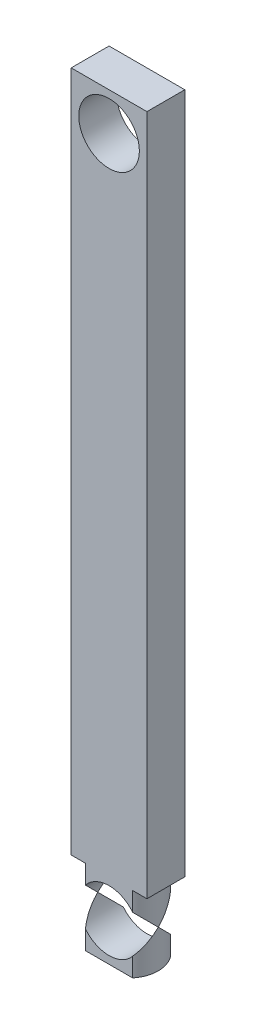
ISO-10303-21;
HEADER;
FILE_DESCRIPTION(('STEP AP214'),'2;1');
FILE_NAME('part.step','',(''),(''),'','','');
FILE_SCHEMA(('AUTOMOTIVE_DESIGN { 1 0 10303 214 1 1 1 1 }'));
ENDSEC;
DATA;
#1=APPLICATION_CONTEXT('core data for automotive mechanical design processes');
#2=APPLICATION_PROTOCOL_DEFINITION('international standard','automotive_design',2000,#1);
#3=PRODUCT_CONTEXT('',#1,'mechanical');
#4=PRODUCT('Part','Part','',(#3));
#5=PRODUCT_RELATED_PRODUCT_CATEGORY('part','',(#4));
#6=PRODUCT_DEFINITION_FORMATION('','',#4);
#7=PRODUCT_DEFINITION_CONTEXT('part definition',#1,'design');
#8=PRODUCT_DEFINITION('design','',#6,#7);
#9=PRODUCT_DEFINITION_SHAPE('','',#8);
#10=(LENGTH_UNIT() NAMED_UNIT(*) SI_UNIT(.MILLI.,.METRE.));
#11=(NAMED_UNIT(*) PLANE_ANGLE_UNIT() SI_UNIT($,.RADIAN.));
#12=(NAMED_UNIT(*) SI_UNIT($,.STERADIAN.) SOLID_ANGLE_UNIT());
#13=UNCERTAINTY_MEASURE_WITH_UNIT(LENGTH_MEASURE(1.E-05),#10,'distance_accuracy_value','');
#14=(GEOMETRIC_REPRESENTATION_CONTEXT(3) GLOBAL_UNCERTAINTY_ASSIGNED_CONTEXT((#13)) GLOBAL_UNIT_ASSIGNED_CONTEXT((#10,
#11,#12)) REPRESENTATION_CONTEXT('',''));
#15=CARTESIAN_POINT('',(0.,0.,0.));
#16=DIRECTION('',(0.,0.,1.));
#17=DIRECTION('',(1.,0.,0.));
#18=AXIS2_PLACEMENT_3D('',#15,#16,#17);
#19=CARTESIAN_POINT('',(-4.99999999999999,-50.,2.5));
#20=DIRECTION('',(0.,0.,1.));
#21=DIRECTION('',(1.,0.,0.));
#22=AXIS2_PLACEMENT_3D('',#19,#20,#21);
#23=PLANE('',#22);
#24=CARTESIAN_POINT('',(0.,45.,2.5));
#25=DIRECTION('',(0.,0.,1.));
#26=DIRECTION('',(1.,0.,0.));
#27=AXIS2_PLACEMENT_3D('',#24,#25,#26);
#28=CIRCLE('',#27,4.00000000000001);
#29=CARTESIAN_POINT('',(4.00000000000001,45.,2.5));
#30=VERTEX_POINT('',#29);
#31=EDGE_CURVE('E504',#30,#30,#28,.T.);
#32=ORIENTED_EDGE('',*,*,#31,.F.);
#33=EDGE_LOOP('',(#32));
#34=FACE_BOUND('',#33,.T.);
#35=DIRECTION('',(0.,-1.,0.));
#36=VECTOR('',#35,1.);
#37=CARTESIAN_POINT('',(-5.,50.,2.5));
#38=LINE('',#37,#36);
#39=CARTESIAN_POINT('',(-5.,50.,2.5));
#40=VERTEX_POINT('',#39);
#41=CARTESIAN_POINT('',(-4.99999999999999,-40.,2.5));
#42=VERTEX_POINT('',#41);
#43=EDGE_CURVE('E511',#40,#42,#38,.T.);
#44=ORIENTED_EDGE('',*,*,#43,.T.);
#45=DIRECTION('',(1.,0.,0.));
#46=VECTOR('',#45,1.);
#47=CARTESIAN_POINT('',(-4.99999999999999,-40.,2.5));
#48=LINE('',#47,#46);
#49=CARTESIAN_POINT('',(-3.1224989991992,-40.,2.5));
#50=VERTEX_POINT('',#49);
#51=EDGE_CURVE('E494',#42,#50,#48,.T.);
#52=ORIENTED_EDGE('',*,*,#51,.T.);
#53=DIRECTION('',(0.,-1.,0.));
#54=VECTOR('',#53,1.);
#55=CARTESIAN_POINT('',(-3.1224989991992,-40.,2.5));
#56=LINE('',#55,#54);
#57=CARTESIAN_POINT('',(-3.12249899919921,-42.5,2.5));
#58=VERTEX_POINT('',#57);
#59=EDGE_CURVE('E492',#50,#58,#56,.T.);
#60=ORIENTED_EDGE('',*,*,#59,.T.);
#61=CARTESIAN_POINT('',(0.,-45.,2.5));
#62=DIRECTION('',(0.,0.,1.));
#63=DIRECTION('',(1.,0.,0.));
#64=AXIS2_PLACEMENT_3D('',#61,#62,#63);
#65=CIRCLE('',#64,4.00000000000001);
#66=CARTESIAN_POINT('',(3.12249899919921,-42.5,2.5));
#67=VERTEX_POINT('',#66);
#68=EDGE_CURVE('E461',#67,#58,#65,.T.);
#69=ORIENTED_EDGE('',*,*,#68,.F.);
#70=DIRECTION('',(0.,-1.,0.));
#71=VECTOR('',#70,1.);
#72=CARTESIAN_POINT('',(3.1224989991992,-40.,2.5));
#73=LINE('',#72,#71);
#74=CARTESIAN_POINT('',(3.1224989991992,-40.,2.5));
#75=VERTEX_POINT('',#74);
#76=EDGE_CURVE('E489',#67,#75,#73,.F.);
#77=ORIENTED_EDGE('',*,*,#76,.T.);
#78=CARTESIAN_POINT('',(5.00000000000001,-40.,2.5));
#79=VERTEX_POINT('',#78);
#80=EDGE_CURVE('E396',#75,#79,#48,.T.);
#81=ORIENTED_EDGE('',*,*,#80,.T.);
#82=DIRECTION('',(0.,1.,0.));
#83=VECTOR('',#82,1.);
#84=CARTESIAN_POINT('',(5.,50.,2.5));
#85=LINE('',#84,#83);
#86=CARTESIAN_POINT('',(5.,50.,2.5));
#87=VERTEX_POINT('',#86);
#88=EDGE_CURVE('E499',#79,#87,#85,.T.);
#89=ORIENTED_EDGE('',*,*,#88,.T.);
#90=DIRECTION('',(-1.,0.,0.));
#91=VECTOR('',#90,1.);
#92=CARTESIAN_POINT('',(-5.,50.,2.5));
#93=LINE('',#92,#91);
#94=EDGE_CURVE('E503',#87,#40,#93,.T.);
#95=ORIENTED_EDGE('',*,*,#94,.T.);
#96=EDGE_LOOP('',(#44,#52,#60,#69,#77,#81,#89,#95));
#97=FACE_BOUND('',#96,.T.);
#98=ADVANCED_FACE('F379',(#34,#97),#23,.T.);
#99=CARTESIAN_POINT('',(-4.99999999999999,-50.,-2.5));
#100=DIRECTION('',(0.,0.,1.));
#101=DIRECTION('',(1.,0.,0.));
#102=AXIS2_PLACEMENT_3D('',#99,#100,#101);
#103=PLANE('',#102);
#104=CARTESIAN_POINT('',(0.,45.,-2.5));
#105=DIRECTION('',(0.,0.,1.));
#106=DIRECTION('',(1.,0.,0.));
#107=AXIS2_PLACEMENT_3D('',#104,#105,#106);
#108=CIRCLE('',#107,4.00000000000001);
#109=CARTESIAN_POINT('',(4.00000000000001,45.,-2.5));
#110=VERTEX_POINT('',#109);
#111=EDGE_CURVE('E496',#110,#110,#108,.T.);
#112=ORIENTED_EDGE('',*,*,#111,.T.);
#113=EDGE_LOOP('',(#112));
#114=FACE_BOUND('',#113,.T.);
#115=DIRECTION('',(1.,0.,0.));
#116=VECTOR('',#115,1.);
#117=CARTESIAN_POINT('',(-4.99999999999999,-40.,-2.5));
#118=LINE('',#117,#116);
#119=CARTESIAN_POINT('',(-4.99999999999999,-40.,-2.5));
#120=VERTEX_POINT('',#119);
#121=CARTESIAN_POINT('',(-3.1224989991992,-40.,-2.5));
#122=VERTEX_POINT('',#121);
#123=EDGE_CURVE('E483',#120,#122,#118,.T.);
#124=ORIENTED_EDGE('',*,*,#123,.F.);
#125=DIRECTION('',(0.,-1.,0.));
#126=VECTOR('',#125,1.);
#127=CARTESIAN_POINT('',(-5.,50.,-2.5));
#128=LINE('',#127,#126);
#129=CARTESIAN_POINT('',(-5.,50.,-2.5));
#130=VERTEX_POINT('',#129);
#131=EDGE_CURVE('E465',#130,#120,#128,.T.);
#132=ORIENTED_EDGE('',*,*,#131,.F.);
#133=DIRECTION('',(-1.,0.,0.));
#134=VECTOR('',#133,1.);
#135=CARTESIAN_POINT('',(-5.,50.,-2.5));
#136=LINE('',#135,#134);
#137=CARTESIAN_POINT('',(5.,50.,-2.5));
#138=VERTEX_POINT('',#137);
#139=EDGE_CURVE('E469',#138,#130,#136,.T.);
#140=ORIENTED_EDGE('',*,*,#139,.F.);
#141=DIRECTION('',(0.,1.,0.));
#142=VECTOR('',#141,1.);
#143=CARTESIAN_POINT('',(5.,50.,-2.5));
#144=LINE('',#143,#142);
#145=CARTESIAN_POINT('',(5.00000000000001,-40.,-2.5));
#146=VERTEX_POINT('',#145);
#147=EDGE_CURVE('E462',#146,#138,#144,.T.);
#148=ORIENTED_EDGE('',*,*,#147,.F.);
#149=CARTESIAN_POINT('',(3.1224989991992,-40.,-2.5));
#150=VERTEX_POINT('',#149);
#151=EDGE_CURVE('E389',#150,#146,#118,.T.);
#152=ORIENTED_EDGE('',*,*,#151,.F.);
#153=DIRECTION('',(0.,-1.,0.));
#154=VECTOR('',#153,1.);
#155=CARTESIAN_POINT('',(3.1224989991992,-40.,-2.5));
#156=LINE('',#155,#154);
#157=CARTESIAN_POINT('',(3.12249899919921,-42.5,-2.5));
#158=VERTEX_POINT('',#157);
#159=EDGE_CURVE('E476',#158,#150,#156,.F.);
#160=ORIENTED_EDGE('',*,*,#159,.F.);
#161=CARTESIAN_POINT('',(0.,-45.,-2.5));
#162=DIRECTION('',(0.,0.,1.));
#163=DIRECTION('',(1.,0.,0.));
#164=AXIS2_PLACEMENT_3D('',#161,#162,#163);
#165=CIRCLE('',#164,4.00000000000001);
#166=CARTESIAN_POINT('',(-3.12249899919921,-42.5,-2.5));
#167=VERTEX_POINT('',#166);
#168=EDGE_CURVE('E471',#158,#167,#165,.T.);
#169=ORIENTED_EDGE('',*,*,#168,.T.);
#170=DIRECTION('',(0.,-1.,0.));
#171=VECTOR('',#170,1.);
#172=CARTESIAN_POINT('',(-3.1224989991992,-40.,-2.5));
#173=LINE('',#172,#171);
#174=EDGE_CURVE('E383',#122,#167,#173,.T.);
#175=ORIENTED_EDGE('',*,*,#174,.F.);
#176=EDGE_LOOP('',(#124,#132,#140,#148,#152,#160,#169,#175));
#177=FACE_BOUND('',#176,.T.);
#178=ADVANCED_FACE('F480',(#114,#177),#103,.F.);
#179=CARTESIAN_POINT('',(-5.,50.,2.5));
#180=DIRECTION('',(1.,0.,0.));
#181=DIRECTION('',(0.,1.,0.));
#182=AXIS2_PLACEMENT_3D('',#179,#180,#181);
#183=PLANE('',#182);
#184=DIRECTION('',(0.,0.,-1.));
#185=VECTOR('',#184,1.);
#186=CARTESIAN_POINT('',(-4.99999999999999,-40.,2.5));
#187=LINE('',#186,#185);
#188=EDGE_CURVE('E486',#42,#120,#187,.T.);
#189=ORIENTED_EDGE('',*,*,#188,.F.);
#190=ORIENTED_EDGE('',*,*,#43,.F.);
#191=DIRECTION('',(0.,0.,-1.));
#192=VECTOR('',#191,1.);
#193=CARTESIAN_POINT('',(-5.,50.,2.5));
#194=LINE('',#193,#192);
#195=EDGE_CURVE('E495',#40,#130,#194,.T.);
#196=ORIENTED_EDGE('',*,*,#195,.T.);
#197=ORIENTED_EDGE('',*,*,#131,.T.);
#198=EDGE_LOOP('',(#189,#190,#196,#197));
#199=FACE_BOUND('',#198,.T.);
#200=ADVANCED_FACE('F529',(#199),#183,.F.);
#201=CARTESIAN_POINT('',(5.,50.,2.5));
#202=DIRECTION('',(-1.,0.,0.));
#203=DIRECTION('',(0.,-1.,0.));
#204=AXIS2_PLACEMENT_3D('',#201,#202,#203);
#205=PLANE('',#204);
#206=DIRECTION('',(0.,0.,1.));
#207=VECTOR('',#206,1.);
#208=CARTESIAN_POINT('',(5.00000000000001,-40.,2.5));
#209=LINE('',#208,#207);
#210=EDGE_CURVE('E13',#146,#79,#209,.T.);
#211=ORIENTED_EDGE('',*,*,#210,.F.);
#212=ORIENTED_EDGE('',*,*,#147,.T.);
#213=DIRECTION('',(0.,0.,-1.));
#214=VECTOR('',#213,1.);
#215=CARTESIAN_POINT('',(5.,50.,2.5));
#216=LINE('',#215,#214);
#217=EDGE_CURVE('E507',#87,#138,#216,.T.);
#218=ORIENTED_EDGE('',*,*,#217,.F.);
#219=ORIENTED_EDGE('',*,*,#88,.F.);
#220=EDGE_LOOP('',(#211,#212,#218,#219));
#221=FACE_BOUND('',#220,.T.);
#222=ADVANCED_FACE('F534',(#221),#205,.F.);
#223=CARTESIAN_POINT('',(0.,-45.,2.5));
#224=DIRECTION('',(0.,0.,-1.));
#225=DIRECTION('',(-1.,0.,0.));
#226=AXIS2_PLACEMENT_3D('',#223,#224,#225);
#227=CYLINDRICAL_SURFACE('',#226,4.00000000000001);
#228=CARTESIAN_POINT('',(0.,-45.,0.));
#229=DIRECTION('',(0.,0.707106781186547,-0.707106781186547));
#230=DIRECTION('',(0.,-0.707106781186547,-0.707106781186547));
#231=AXIS2_PLACEMENT_3D('',#228,#229,#230);
#232=ELLIPSE('',#231,5.65685424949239,4.);
#233=CARTESIAN_POINT('',(-4.,-45.,0.));
#234=VERTEX_POINT('',#233);
#235=EDGE_CURVE('E448',#58,#234,#232,.F.);
#236=ORIENTED_EDGE('',*,*,#235,.T.);
#237=CARTESIAN_POINT('',(0.,-45.,0.));
#238=DIRECTION('',(0.,-0.707106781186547,-0.707106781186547));
#239=DIRECTION('',(0.,0.707106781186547,-0.707106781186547));
#240=AXIS2_PLACEMENT_3D('',#237,#238,#239);
#241=ELLIPSE('',#240,5.65685424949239,4.);
#242=EDGE_CURVE('E446',#234,#167,#241,.T.);
#243=ORIENTED_EDGE('',*,*,#242,.T.);
#244=ORIENTED_EDGE('',*,*,#168,.F.);
#245=CARTESIAN_POINT('',(4.,-45.,0.));
#246=VERTEX_POINT('',#245);
#247=EDGE_CURVE('E455',#158,#246,#241,.T.);
#248=ORIENTED_EDGE('',*,*,#247,.T.);
#249=EDGE_CURVE('E464',#246,#67,#232,.F.);
#250=ORIENTED_EDGE('',*,*,#249,.T.);
#251=ORIENTED_EDGE('',*,*,#68,.T.);
#252=EDGE_LOOP('',(#236,#243,#244,#248,#250,#251));
#253=FACE_BOUND('',#252,.T.);
#254=ADVANCED_FACE('F458',(#253),#227,.F.);
#255=CARTESIAN_POINT('',(-5.,50.,2.5));
#256=DIRECTION('',(0.,-1.,0.));
#257=DIRECTION('',(0.,0.,-1.));
#258=AXIS2_PLACEMENT_3D('',#255,#256,#257);
#259=PLANE('',#258);
#260=ORIENTED_EDGE('',*,*,#139,.T.);
#261=ORIENTED_EDGE('',*,*,#195,.F.);
#262=ORIENTED_EDGE('',*,*,#94,.F.);
#263=ORIENTED_EDGE('',*,*,#217,.T.);
#264=EDGE_LOOP('',(#260,#261,#262,#263));
#265=FACE_BOUND('',#264,.T.);
#266=ADVANCED_FACE('F522',(#265),#259,.F.);
#267=CARTESIAN_POINT('',(0.,45.,2.5));
#268=DIRECTION('',(0.,0.,-1.));
#269=DIRECTION('',(-1.,0.,0.));
#270=AXIS2_PLACEMENT_3D('',#267,#268,#269);
#271=CYLINDRICAL_SURFACE('',#270,4.00000000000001);
#272=ORIENTED_EDGE('',*,*,#31,.T.);
#273=EDGE_LOOP('',(#272));
#274=FACE_BOUND('',#273,.T.);
#275=ORIENTED_EDGE('',*,*,#111,.F.);
#276=EDGE_LOOP('',(#275));
#277=FACE_BOUND('',#276,.T.);
#278=ADVANCED_FACE('F545',(#274,#277),#271,.F.);
#279=CARTESIAN_POINT('',(0.,-40.,0.));
#280=DIRECTION('',(0.,-1.,0.));
#281=DIRECTION('',(0.,0.,-1.));
#282=AXIS2_PLACEMENT_3D('',#279,#280,#281);
#283=CYLINDRICAL_SURFACE('',#282,4.);
#284=ORIENTED_EDGE('',*,*,#174,.T.);
#285=ORIENTED_EDGE('',*,*,#242,.F.);
#286=ORIENTED_EDGE('',*,*,#235,.F.);
#287=ORIENTED_EDGE('',*,*,#59,.F.);
#288=CARTESIAN_POINT('',(0.,-40.,0.));
#289=DIRECTION('',(0.,-1.,0.));
#290=DIRECTION('',(0.,0.,-1.));
#291=AXIS2_PLACEMENT_3D('',#288,#289,#290);
#292=CIRCLE('',#291,4.);
#293=EDGE_CURVE('E485',#50,#122,#292,.T.);
#294=ORIENTED_EDGE('',*,*,#293,.T.);
#295=EDGE_LOOP('',(#284,#285,#286,#287,#294));
#296=FACE_BOUND('',#295,.T.);
#297=ADVANCED_FACE('F381',(#296),#283,.T.);
#298=CARTESIAN_POINT('',(0.,-40.,0.));
#299=DIRECTION('',(0.,-1.,0.));
#300=DIRECTION('',(0.,0.,-1.));
#301=AXIS2_PLACEMENT_3D('',#298,#299,#300);
#302=PLANE('',#301);
#303=ORIENTED_EDGE('',*,*,#188,.T.);
#304=ORIENTED_EDGE('',*,*,#123,.T.);
#305=ORIENTED_EDGE('',*,*,#293,.F.);
#306=ORIENTED_EDGE('',*,*,#51,.F.);
#307=EDGE_LOOP('',(#303,#304,#305,#306));
#308=FACE_BOUND('',#307,.T.);
#309=ADVANCED_FACE('F538',(#308),#302,.T.);
#310=ORIENTED_EDGE('',*,*,#159,.T.);
#311=EDGE_CURVE('E482',#150,#75,#292,.T.);
#312=ORIENTED_EDGE('',*,*,#311,.T.);
#313=ORIENTED_EDGE('',*,*,#76,.F.);
#314=ORIENTED_EDGE('',*,*,#249,.F.);
#315=ORIENTED_EDGE('',*,*,#247,.F.);
#316=EDGE_LOOP('',(#310,#312,#313,#314,#315));
#317=FACE_BOUND('',#316,.T.);
#318=ADVANCED_FACE('F475',(#317),#283,.T.);
#319=ORIENTED_EDGE('',*,*,#311,.F.);
#320=ORIENTED_EDGE('',*,*,#151,.T.);
#321=ORIENTED_EDGE('',*,*,#210,.T.);
#322=ORIENTED_EDGE('',*,*,#80,.F.);
#323=EDGE_LOOP('',(#319,#320,#321,#322));
#324=FACE_BOUND('',#323,.T.);
#325=ADVANCED_FACE('F535',(#324),#302,.T.);
#326=CLOSED_SHELL('',(#98,#178,#200,#222,#254,#266,#278,#297,#309,#318,#325));
#327=MANIFOLD_SOLID_BREP('B2',#326);
#328=CARTESIAN_POINT('',(-4.99999999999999,-50.,2.5));
#329=DIRECTION('',(0.,1.,0.));
#330=DIRECTION('',(0.,0.,1.));
#331=AXIS2_PLACEMENT_3D('',#328,#329,#330);
#332=PLANE('',#331);
#333=CARTESIAN_POINT('',(0.,-50.,0.));
#334=DIRECTION('',(0.,-1.,0.));
#335=DIRECTION('',(0.,0.,-1.));
#336=AXIS2_PLACEMENT_3D('',#333,#334,#335);
#337=CIRCLE('',#336,4.);
#338=CARTESIAN_POINT('',(3.1224989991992,-50.,-2.5));
#339=VERTEX_POINT('',#338);
#340=CARTESIAN_POINT('',(3.1224989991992,-50.,2.5));
#341=VERTEX_POINT('',#340);
#342=EDGE_CURVE('E653',#339,#341,#337,.T.);
#343=ORIENTED_EDGE('',*,*,#342,.T.);
#344=DIRECTION('',(1.,0.,0.));
#345=VECTOR('',#344,1.);
#346=CARTESIAN_POINT('',(-4.99999999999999,-50.,2.5));
#347=LINE('',#346,#345);
#348=CARTESIAN_POINT('',(-3.1224989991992,-50.,2.5));
#349=VERTEX_POINT('',#348);
#350=EDGE_CURVE('E676',#349,#341,#347,.T.);
#351=ORIENTED_EDGE('',*,*,#350,.F.);
#352=CARTESIAN_POINT('',(-3.1224989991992,-50.,-2.5));
#353=VERTEX_POINT('',#352);
#354=EDGE_CURVE('E664',#349,#353,#337,.T.);
#355=ORIENTED_EDGE('',*,*,#354,.T.);
#356=DIRECTION('',(1.,0.,0.));
#357=VECTOR('',#356,1.);
#358=CARTESIAN_POINT('',(-4.99999999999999,-50.,-2.5));
#359=LINE('',#358,#357);
#360=EDGE_CURVE('E671',#353,#339,#359,.T.);
#361=ORIENTED_EDGE('',*,*,#360,.T.);
#362=EDGE_LOOP('',(#343,#351,#355,#361));
#363=FACE_BOUND('',#362,.T.);
#364=ADVANCED_FACE('F611',(#363),#332,.F.);
#365=CARTESIAN_POINT('',(0.,-45.,2.5));
#366=DIRECTION('',(0.,0.,-1.));
#367=DIRECTION('',(-1.,0.,0.));
#368=AXIS2_PLACEMENT_3D('',#365,#366,#367);
#369=CYLINDRICAL_SURFACE('',#368,4.00000000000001);
#370=CARTESIAN_POINT('',(0.,-45.,0.));
#371=DIRECTION('',(0.,0.707106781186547,-0.707106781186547));
#372=DIRECTION('',(0.,-0.707106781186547,-0.707106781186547));
#373=AXIS2_PLACEMENT_3D('',#370,#371,#372);
#374=ELLIPSE('',#373,5.65685424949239,4.);
#375=CARTESIAN_POINT('',(-3.12249899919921,-47.5,-2.5));
#376=VERTEX_POINT('',#375);
#377=CARTESIAN_POINT('',(-4.,-45.,0.));
#378=VERTEX_POINT('',#377);
#379=EDGE_CURVE('E679',#376,#378,#374,.T.);
#380=ORIENTED_EDGE('',*,*,#379,.T.);
#381=CARTESIAN_POINT('',(0.,-45.,0.));
#382=DIRECTION('',(0.,-0.707106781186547,-0.707106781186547));
#383=DIRECTION('',(0.,0.707106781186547,-0.707106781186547));
#384=AXIS2_PLACEMENT_3D('',#381,#382,#383);
#385=ELLIPSE('',#384,5.65685424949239,4.);
#386=CARTESIAN_POINT('',(-3.12249899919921,-47.5,2.5));
#387=VERTEX_POINT('',#386);
#388=EDGE_CURVE('E377',#378,#387,#385,.F.);
#389=ORIENTED_EDGE('',*,*,#388,.T.);
#390=CARTESIAN_POINT('',(0.,-45.,2.5));
#391=DIRECTION('',(0.,0.,1.));
#392=DIRECTION('',(1.,0.,0.));
#393=AXIS2_PLACEMENT_3D('',#390,#391,#392);
#394=CIRCLE('',#393,4.00000000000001);
#395=CARTESIAN_POINT('',(3.12249899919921,-47.5,2.5));
#396=VERTEX_POINT('',#395);
#397=EDGE_CURVE('E677',#387,#396,#394,.T.);
#398=ORIENTED_EDGE('',*,*,#397,.T.);
#399=CARTESIAN_POINT('',(4.,-45.,0.));
#400=VERTEX_POINT('',#399);
#401=EDGE_CURVE('E614',#396,#400,#385,.F.);
#402=ORIENTED_EDGE('',*,*,#401,.T.);
#403=CARTESIAN_POINT('',(3.12249899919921,-47.5,-2.5));
#404=VERTEX_POINT('',#403);
#405=EDGE_CURVE('E625',#400,#404,#374,.T.);
#406=ORIENTED_EDGE('',*,*,#405,.T.);
#407=CARTESIAN_POINT('',(0.,-45.,-2.5));
#408=DIRECTION('',(0.,0.,1.));
#409=DIRECTION('',(1.,0.,0.));
#410=AXIS2_PLACEMENT_3D('',#407,#408,#409);
#411=CIRCLE('',#410,4.00000000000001);
#412=EDGE_CURVE('E673',#376,#404,#411,.T.);
#413=ORIENTED_EDGE('',*,*,#412,.F.);
#414=EDGE_LOOP('',(#380,#389,#398,#402,#406,#413));
#415=FACE_BOUND('',#414,.T.);
#416=ADVANCED_FACE('F685',(#415),#369,.F.);
#417=CARTESIAN_POINT('',(-4.99999999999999,-50.,-2.5));
#418=DIRECTION('',(0.,0.,1.));
#419=DIRECTION('',(1.,0.,0.));
#420=AXIS2_PLACEMENT_3D('',#417,#418,#419);
#421=PLANE('',#420);
#422=DIRECTION('',(0.,-1.,0.));
#423=VECTOR('',#422,1.);
#424=CARTESIAN_POINT('',(-3.1224989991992,-40.,-2.5));
#425=LINE('',#424,#423);
#426=EDGE_CURVE('E663',#376,#353,#425,.T.);
#427=ORIENTED_EDGE('',*,*,#426,.F.);
#428=ORIENTED_EDGE('',*,*,#412,.T.);
#429=DIRECTION('',(0.,-1.,0.));
#430=VECTOR('',#429,1.);
#431=CARTESIAN_POINT('',(3.1224989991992,-40.,-2.5));
#432=LINE('',#431,#430);
#433=EDGE_CURVE('E656',#339,#404,#432,.F.);
#434=ORIENTED_EDGE('',*,*,#433,.F.);
#435=ORIENTED_EDGE('',*,*,#360,.F.);
#436=EDGE_LOOP('',(#427,#428,#434,#435));
#437=FACE_BOUND('',#436,.T.);
#438=ADVANCED_FACE('F670',(#437),#421,.F.);
#439=CARTESIAN_POINT('',(-4.99999999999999,-50.,2.5));
#440=DIRECTION('',(0.,0.,1.));
#441=DIRECTION('',(1.,0.,0.));
#442=AXIS2_PLACEMENT_3D('',#439,#440,#441);
#443=PLANE('',#442);
#444=ORIENTED_EDGE('',*,*,#397,.F.);
#445=DIRECTION('',(0.,-1.,0.));
#446=VECTOR('',#445,1.);
#447=CARTESIAN_POINT('',(-3.1224989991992,-40.,2.5));
#448=LINE('',#447,#446);
#449=EDGE_CURVE('E690',#387,#349,#448,.T.);
#450=ORIENTED_EDGE('',*,*,#449,.T.);
#451=ORIENTED_EDGE('',*,*,#350,.T.);
#452=DIRECTION('',(0.,-1.,0.));
#453=VECTOR('',#452,1.);
#454=CARTESIAN_POINT('',(3.1224989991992,-40.,2.5));
#455=LINE('',#454,#453);
#456=EDGE_CURVE('E658',#341,#396,#455,.F.);
#457=ORIENTED_EDGE('',*,*,#456,.T.);
#458=EDGE_LOOP('',(#444,#450,#451,#457));
#459=FACE_BOUND('',#458,.T.);
#460=ADVANCED_FACE('F688',(#459),#443,.T.);
#461=CARTESIAN_POINT('',(0.,-40.,0.));
#462=DIRECTION('',(0.,-1.,0.));
#463=DIRECTION('',(0.,0.,-1.));
#464=AXIS2_PLACEMENT_3D('',#461,#462,#463);
#465=CYLINDRICAL_SURFACE('',#464,4.);
#466=ORIENTED_EDGE('',*,*,#388,.F.);
#467=ORIENTED_EDGE('',*,*,#379,.F.);
#468=ORIENTED_EDGE('',*,*,#426,.T.);
#469=ORIENTED_EDGE('',*,*,#354,.F.);
#470=ORIENTED_EDGE('',*,*,#449,.F.);
#471=EDGE_LOOP('',(#466,#467,#468,#469,#470));
#472=FACE_BOUND('',#471,.T.);
#473=ADVANCED_FACE('F694',(#472),#465,.T.);
#474=ORIENTED_EDGE('',*,*,#342,.F.);
#475=ORIENTED_EDGE('',*,*,#433,.T.);
#476=ORIENTED_EDGE('',*,*,#405,.F.);
#477=ORIENTED_EDGE('',*,*,#401,.F.);
#478=ORIENTED_EDGE('',*,*,#456,.F.);
#479=EDGE_LOOP('',(#474,#475,#476,#477,#478));
#480=FACE_BOUND('',#479,.T.);
#481=ADVANCED_FACE('F655',(#480),#465,.T.);
#482=CLOSED_SHELL('',(#364,#416,#438,#460,#473,#481));
#483=MANIFOLD_SOLID_BREP('B7',#482);
#484=ADVANCED_BREP_SHAPE_REPRESENTATION('',(#18,#327,#483),#14);
#485=SHAPE_DEFINITION_REPRESENTATION(#9,#484);
ENDSEC;
END-ISO-10303-21;
